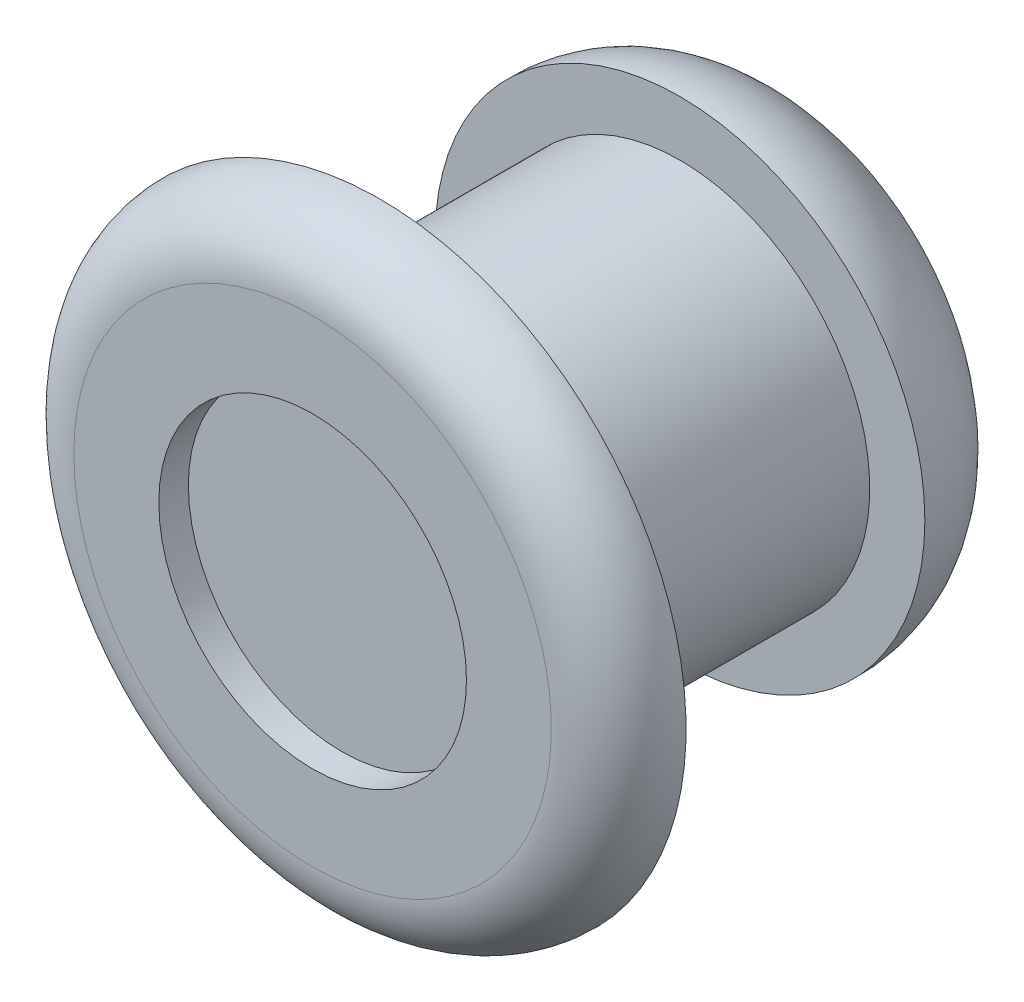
from build123d import *


with BuildPart() as part:
    # Esquisse3 → R_volution1 (revolve)
    with BuildSketch(Plane(origin=(44.000069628, 0, 0), x_dir=(0, 0, -1), z_dir=(1, 0, 0)), mode=Mode.PRIVATE) as r_volution1_sk:
        with BuildLine():
            Line((4.9, -41.360234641), (0, -41.360234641))
            Line((0, -41.360234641), (0, -39.460234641))
            ThreePointArc((0, -39.460234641), (-0.777817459, -39.782417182), (-1.1, -40.560234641))
            Line((-1.1, -40.560234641), (-1.1, -41.947567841))
            Line((-1.1, -41.947567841), (-0.617184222, -41.947567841))
            Line((-0.617184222, -41.947567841), (-0.617184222, -42.710234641))
            Line((-0.617184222, -42.710234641), (-0.617184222, -44.460234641))
            Line((-0.617184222, -44.460234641), (0.95920706, -44.460234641))
            Line((0.95920706, -44.460234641), (0.95920706, -42.710234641))
            Line((0.95920706, -42.710234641), (6.9, -42.710234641))
            Line((6.9, -42.710234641), (6.9, -42.328901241))
            ThreePointArc((6.9, -42.328901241), (6.287013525, -40.980354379), (4.9, -40.460234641))
            Line((4.9, -40.460234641), (4.9, -41.360234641))
        make_face()
    revolve(r_volution1_sk.sketch.rotate(Axis((44.000069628, -44.460234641, -4.9), (0, 0, 1)), 90), axis=Axis((44.000069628, -44.460234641, -4.9), (0, 0, 1)))


solid = part.part
